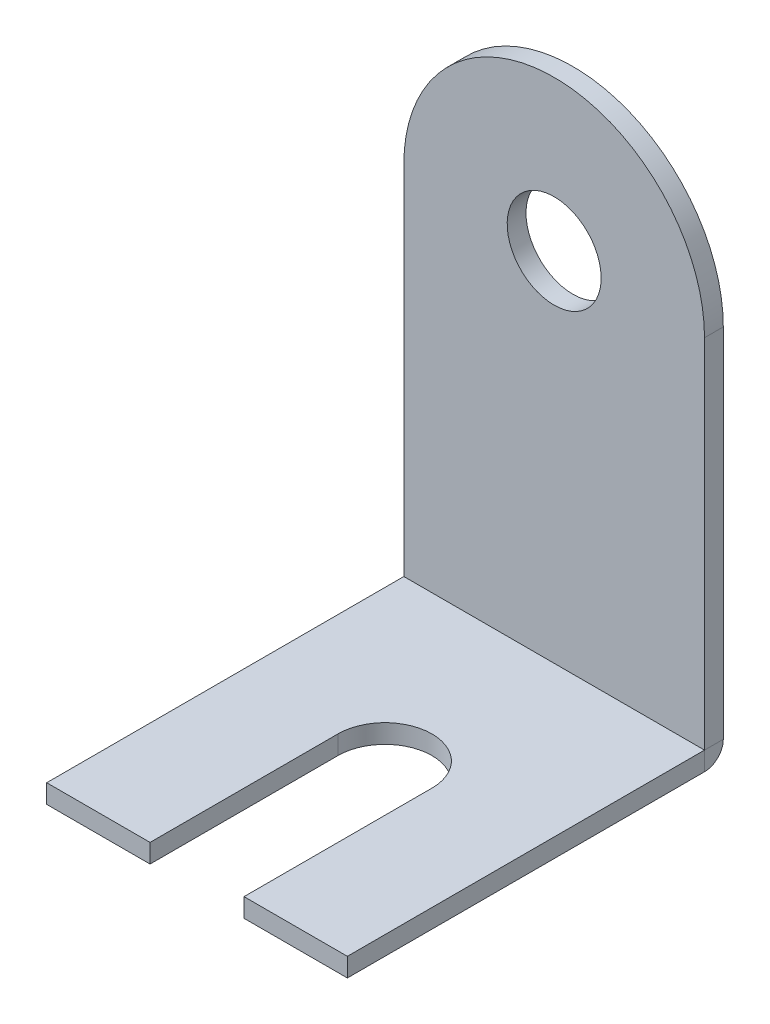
ISO-10303-21;
HEADER;
FILE_DESCRIPTION(('STEP AP214'),'2;1');
FILE_NAME('part.step','',(''),(''),'','','');
FILE_SCHEMA(('AUTOMOTIVE_DESIGN { 1 0 10303 214 1 1 1 1 }'));
ENDSEC;
DATA;
#1=APPLICATION_CONTEXT('core data for automotive mechanical design processes');
#2=APPLICATION_PROTOCOL_DEFINITION('international standard','automotive_design',2000,#1);
#3=PRODUCT_CONTEXT('',#1,'mechanical');
#4=PRODUCT('Part','Part','',(#3));
#5=PRODUCT_RELATED_PRODUCT_CATEGORY('part','',(#4));
#6=PRODUCT_DEFINITION_FORMATION('','',#4);
#7=PRODUCT_DEFINITION_CONTEXT('part definition',#1,'design');
#8=PRODUCT_DEFINITION('design','',#6,#7);
#9=PRODUCT_DEFINITION_SHAPE('','',#8);
#10=(LENGTH_UNIT() NAMED_UNIT(*) SI_UNIT(.MILLI.,.METRE.));
#11=(NAMED_UNIT(*) PLANE_ANGLE_UNIT() SI_UNIT($,.RADIAN.));
#12=(NAMED_UNIT(*) SI_UNIT($,.STERADIAN.) SOLID_ANGLE_UNIT());
#13=UNCERTAINTY_MEASURE_WITH_UNIT(LENGTH_MEASURE(1.E-05),#10,'distance_accuracy_value','');
#14=(GEOMETRIC_REPRESENTATION_CONTEXT(3) GLOBAL_UNCERTAINTY_ASSIGNED_CONTEXT((#13)) GLOBAL_UNIT_ASSIGNED_CONTEXT((#10,
#11,#12)) REPRESENTATION_CONTEXT('',''));
#15=CARTESIAN_POINT('',(0.,0.,0.));
#16=DIRECTION('',(0.,0.,1.));
#17=DIRECTION('',(1.,0.,0.));
#18=AXIS2_PLACEMENT_3D('',#15,#16,#17);
#19=CARTESIAN_POINT('',(16.,-19.995,-19.0050000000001));
#20=DIRECTION('',(-1.,0.,0.));
#21=DIRECTION('',(0.,-1.,0.));
#22=AXIS2_PLACEMENT_3D('',#19,#20,#21);
#23=PLANE('',#22);
#24=DIRECTION('',(0.,1.,0.));
#25=VECTOR('',#24,1.);
#26=CARTESIAN_POINT('',(16.,-19.995,-19.0050000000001));
#27=LINE('',#26,#25);
#28=CARTESIAN_POINT('',(16.,1.,-19.005));
#29=VERTEX_POINT('',#28);
#30=CARTESIAN_POINT('',(16.,20.005,-19.0049999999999));
#31=VERTEX_POINT('',#30);
#32=EDGE_CURVE('E39',#29,#31,#27,.T.);
#33=ORIENTED_EDGE('',*,*,#32,.F.);
#34=DIRECTION('',(0.,0.,-1.));
#35=VECTOR('',#34,1.);
#36=CARTESIAN_POINT('',(16.,1.,-19.005));
#37=LINE('',#36,#35);
#38=CARTESIAN_POINT('',(16.,1.,-20.005));
#39=VERTEX_POINT('',#38);
#40=EDGE_CURVE('E12',#29,#39,#37,.T.);
#41=ORIENTED_EDGE('',*,*,#40,.T.);
#42=DIRECTION('',(0.,1.,0.));
#43=VECTOR('',#42,1.);
#44=CARTESIAN_POINT('',(16.,-19.995,-20.0050000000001));
#45=LINE('',#44,#43);
#46=CARTESIAN_POINT('',(16.,20.005,-20.0049999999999));
#47=VERTEX_POINT('',#46);
#48=EDGE_CURVE('E146',#39,#47,#45,.T.);
#49=ORIENTED_EDGE('',*,*,#48,.T.);
#50=DIRECTION('',(0.,0.,-1.));
#51=VECTOR('',#50,1.);
#52=CARTESIAN_POINT('',(16.,20.005,-19.0049999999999));
#53=LINE('',#52,#51);
#54=EDGE_CURVE('E137',#31,#47,#53,.T.);
#55=ORIENTED_EDGE('',*,*,#54,.F.);
#56=EDGE_LOOP('',(#33,#41,#49,#55));
#57=FACE_BOUND('',#56,.T.);
#58=ADVANCED_FACE('F36',(#57),#23,.F.);
#59=CARTESIAN_POINT('',(0.,-19.995,-19.0050000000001));
#60=DIRECTION('',(1.,0.,0.));
#61=DIRECTION('',(0.,1.,0.));
#62=AXIS2_PLACEMENT_3D('',#59,#60,#61);
#63=PLANE('',#62);
#64=DIRECTION('',(0.,-1.,0.));
#65=VECTOR('',#64,1.);
#66=CARTESIAN_POINT('',(0.,-19.995,-20.0050000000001));
#67=LINE('',#66,#65);
#68=CARTESIAN_POINT('',(0.,20.005,-20.0049999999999));
#69=VERTEX_POINT('',#68);
#70=CARTESIAN_POINT('',(0.,1.00000000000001,-20.005));
#71=VERTEX_POINT('',#70);
#72=EDGE_CURVE('E141',#69,#71,#67,.T.);
#73=ORIENTED_EDGE('',*,*,#72,.T.);
#74=DIRECTION('',(0.,0.,1.));
#75=VECTOR('',#74,1.);
#76=CARTESIAN_POINT('',(0.,1.,-19.005));
#77=LINE('',#76,#75);
#78=CARTESIAN_POINT('',(0.,1.,-19.005));
#79=VERTEX_POINT('',#78);
#80=EDGE_CURVE('E130',#71,#79,#77,.T.);
#81=ORIENTED_EDGE('',*,*,#80,.T.);
#82=DIRECTION('',(0.,-1.,0.));
#83=VECTOR('',#82,1.);
#84=CARTESIAN_POINT('',(0.,-19.995,-19.0050000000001));
#85=LINE('',#84,#83);
#86=CARTESIAN_POINT('',(0.,20.005,-19.0049999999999));
#87=VERTEX_POINT('',#86);
#88=EDGE_CURVE('E155',#87,#79,#85,.T.);
#89=ORIENTED_EDGE('',*,*,#88,.F.);
#90=DIRECTION('',(0.,0.,-1.));
#91=VECTOR('',#90,1.);
#92=CARTESIAN_POINT('',(0.,20.005,-19.0049999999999));
#93=LINE('',#92,#91);
#94=EDGE_CURVE('E143',#87,#69,#93,.T.);
#95=ORIENTED_EDGE('',*,*,#94,.T.);
#96=EDGE_LOOP('',(#73,#81,#89,#95));
#97=FACE_BOUND('',#96,.T.);
#98=ADVANCED_FACE('F142',(#97),#63,.F.);
#99=CARTESIAN_POINT('',(8.,20.005,-20.0049999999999));
#100=DIRECTION('',(0.,0.,1.));
#101=DIRECTION('',(0.,-1.,0.));
#102=AXIS2_PLACEMENT_3D('',#99,#100,#101);
#103=PLANE('',#102);
#104=CARTESIAN_POINT('',(8.,20.005,-20.0049999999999));
#105=DIRECTION('',(0.,0.,1.));
#106=DIRECTION('',(0.,-1.,0.));
#107=AXIS2_PLACEMENT_3D('',#104,#105,#106);
#108=CIRCLE('',#107,2.5);
#109=CARTESIAN_POINT('',(8.,17.505,-20.0049999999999));
#110=VERTEX_POINT('',#109);
#111=EDGE_CURVE('E214',#110,#110,#108,.T.);
#112=ORIENTED_EDGE('',*,*,#111,.T.);
#113=EDGE_LOOP('',(#112));
#114=FACE_BOUND('',#113,.T.);
#115=ORIENTED_EDGE('',*,*,#48,.F.);
#116=DIRECTION('',(-1.,0.,0.));
#117=VECTOR('',#116,1.);
#118=CARTESIAN_POINT('',(8.,1.,-20.005));
#119=LINE('',#118,#117);
#120=EDGE_CURVE('E44',#39,#71,#119,.T.);
#121=ORIENTED_EDGE('',*,*,#120,.T.);
#122=ORIENTED_EDGE('',*,*,#72,.F.);
#123=CARTESIAN_POINT('',(8.,20.005,-20.0049999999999));
#124=DIRECTION('',(0.,0.,1.));
#125=DIRECTION('',(0.,-1.,0.));
#126=AXIS2_PLACEMENT_3D('',#123,#124,#125);
#127=CIRCLE('',#126,8.);
#128=EDGE_CURVE('E154',#47,#69,#127,.T.);
#129=ORIENTED_EDGE('',*,*,#128,.F.);
#130=EDGE_LOOP('',(#115,#121,#122,#129));
#131=FACE_BOUND('',#130,.T.);
#132=ADVANCED_FACE('F150',(#114,#131),#103,.F.);
#133=CARTESIAN_POINT('',(8.,20.005,-19.0049999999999));
#134=DIRECTION('',(0.,0.,1.));
#135=DIRECTION('',(0.,-1.,0.));
#136=AXIS2_PLACEMENT_3D('',#133,#134,#135);
#137=PLANE('',#136);
#138=DIRECTION('',(-1.,0.,0.));
#139=VECTOR('',#138,1.);
#140=CARTESIAN_POINT('',(8.,1.,-19.005));
#141=LINE('',#140,#139);
#142=EDGE_CURVE('E175',#29,#79,#141,.T.);
#143=ORIENTED_EDGE('',*,*,#142,.F.);
#144=ORIENTED_EDGE('',*,*,#32,.T.);
#145=CARTESIAN_POINT('',(8.,20.005,-19.0049999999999));
#146=DIRECTION('',(0.,0.,1.));
#147=DIRECTION('',(0.,-1.,0.));
#148=AXIS2_PLACEMENT_3D('',#145,#146,#147);
#149=CIRCLE('',#148,8.);
#150=EDGE_CURVE('E59',#31,#87,#149,.T.);
#151=ORIENTED_EDGE('',*,*,#150,.T.);
#152=ORIENTED_EDGE('',*,*,#88,.T.);
#153=EDGE_LOOP('',(#143,#144,#151,#152));
#154=FACE_BOUND('',#153,.T.);
#155=CARTESIAN_POINT('',(8.,20.005,-19.0049999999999));
#156=DIRECTION('',(0.,0.,1.));
#157=DIRECTION('',(0.,-1.,0.));
#158=AXIS2_PLACEMENT_3D('',#155,#156,#157);
#159=CIRCLE('',#158,2.5);
#160=CARTESIAN_POINT('',(8.,17.505,-19.0049999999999));
#161=VERTEX_POINT('',#160);
#162=EDGE_CURVE('E147',#161,#161,#159,.T.);
#163=ORIENTED_EDGE('',*,*,#162,.F.);
#164=EDGE_LOOP('',(#163));
#165=FACE_BOUND('',#164,.T.);
#166=ADVANCED_FACE('F176',(#154,#165),#137,.T.);
#167=CARTESIAN_POINT('',(8.,20.005,-19.0049999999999));
#168=DIRECTION('',(0.,0.,-1.));
#169=DIRECTION('',(0.,1.,0.));
#170=AXIS2_PLACEMENT_3D('',#167,#168,#169);
#171=CYLINDRICAL_SURFACE('',#170,8.);
#172=ORIENTED_EDGE('',*,*,#128,.T.);
#173=ORIENTED_EDGE('',*,*,#94,.F.);
#174=ORIENTED_EDGE('',*,*,#150,.F.);
#175=ORIENTED_EDGE('',*,*,#54,.T.);
#176=EDGE_LOOP('',(#172,#173,#174,#175));
#177=FACE_BOUND('',#176,.T.);
#178=ADVANCED_FACE('F165',(#177),#171,.T.);
#179=CARTESIAN_POINT('',(8.,20.005,-19.0049999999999));
#180=DIRECTION('',(0.,0.,-1.));
#181=DIRECTION('',(0.,1.,0.));
#182=AXIS2_PLACEMENT_3D('',#179,#180,#181);
#183=CYLINDRICAL_SURFACE('',#182,2.5);
#184=ORIENTED_EDGE('',*,*,#162,.T.);
#185=EDGE_LOOP('',(#184));
#186=FACE_BOUND('',#185,.T.);
#187=ORIENTED_EDGE('',*,*,#111,.F.);
#188=EDGE_LOOP('',(#187));
#189=FACE_BOUND('',#188,.T.);
#190=ADVANCED_FACE('F290',(#186,#189),#183,.F.);
#191=CARTESIAN_POINT('',(10.5,1.,0.));
#192=DIRECTION('',(0.,0.,-1.));
#193=DIRECTION('',(-1.,0.,0.));
#194=AXIS2_PLACEMENT_3D('',#191,#192,#193);
#195=PLANE('',#194);
#196=DIRECTION('',(1.,0.,0.));
#197=VECTOR('',#196,1.);
#198=CARTESIAN_POINT('',(10.5,0.,0.));
#199=LINE('',#198,#197);
#200=CARTESIAN_POINT('',(10.5,0.,0.));
#201=VERTEX_POINT('',#200);
#202=CARTESIAN_POINT('',(16.,0.,0.));
#203=VERTEX_POINT('',#202);
#204=EDGE_CURVE('E210',#201,#203,#199,.T.);
#205=ORIENTED_EDGE('',*,*,#204,.T.);
#206=DIRECTION('',(0.,-1.,0.));
#207=VECTOR('',#206,1.);
#208=CARTESIAN_POINT('',(16.,1.,0.));
#209=LINE('',#208,#207);
#210=CARTESIAN_POINT('',(16.,1.,0.));
#211=VERTEX_POINT('',#210);
#212=EDGE_CURVE('E220',#211,#203,#209,.T.);
#213=ORIENTED_EDGE('',*,*,#212,.F.);
#214=DIRECTION('',(1.,0.,0.));
#215=VECTOR('',#214,1.);
#216=CARTESIAN_POINT('',(10.5,1.,0.));
#217=LINE('',#216,#215);
#218=CARTESIAN_POINT('',(10.5,1.,0.));
#219=VERTEX_POINT('',#218);
#220=EDGE_CURVE('E230',#219,#211,#217,.T.);
#221=ORIENTED_EDGE('',*,*,#220,.F.);
#222=DIRECTION('',(0.,-1.,0.));
#223=VECTOR('',#222,1.);
#224=CARTESIAN_POINT('',(10.5,1.,0.));
#225=LINE('',#224,#223);
#226=EDGE_CURVE('E207',#219,#201,#225,.T.);
#227=ORIENTED_EDGE('',*,*,#226,.T.);
#228=EDGE_LOOP('',(#205,#213,#221,#227));
#229=FACE_BOUND('',#228,.T.);
#230=ADVANCED_FACE('F263',(#229),#195,.F.);
#231=CARTESIAN_POINT('',(10.5,1.,-10.));
#232=DIRECTION('',(1.,0.,0.));
#233=DIRECTION('',(0.,0.,-1.));
#234=AXIS2_PLACEMENT_3D('',#231,#232,#233);
#235=PLANE('',#234);
#236=DIRECTION('',(0.,0.,1.));
#237=VECTOR('',#236,1.);
#238=CARTESIAN_POINT('',(10.5,0.,-10.));
#239=LINE('',#238,#237);
#240=CARTESIAN_POINT('',(10.5,0.,-10.));
#241=VERTEX_POINT('',#240);
#242=EDGE_CURVE('E205',#241,#201,#239,.T.);
#243=ORIENTED_EDGE('',*,*,#242,.T.);
#244=ORIENTED_EDGE('',*,*,#226,.F.);
#245=DIRECTION('',(0.,0.,1.));
#246=VECTOR('',#245,1.);
#247=CARTESIAN_POINT('',(10.5,1.,-10.));
#248=LINE('',#247,#246);
#249=CARTESIAN_POINT('',(10.5,1.,-10.));
#250=VERTEX_POINT('',#249);
#251=EDGE_CURVE('E232',#250,#219,#248,.T.);
#252=ORIENTED_EDGE('',*,*,#251,.F.);
#253=DIRECTION('',(0.,-1.,0.));
#254=VECTOR('',#253,1.);
#255=CARTESIAN_POINT('',(10.5,1.,-10.));
#256=LINE('',#255,#254);
#257=EDGE_CURVE('E202',#250,#241,#256,.T.);
#258=ORIENTED_EDGE('',*,*,#257,.T.);
#259=EDGE_LOOP('',(#243,#244,#252,#258));
#260=FACE_BOUND('',#259,.T.);
#261=ADVANCED_FACE('F259',(#260),#235,.F.);
#262=CARTESIAN_POINT('',(8.,1.,-10.));
#263=DIRECTION('',(0.,-1.,0.));
#264=DIRECTION('',(0.,0.,-1.));
#265=AXIS2_PLACEMENT_3D('',#262,#263,#264);
#266=CYLINDRICAL_SURFACE('',#265,2.5);
#267=CARTESIAN_POINT('',(8.,0.,-10.));
#268=DIRECTION('',(0.,-1.,0.));
#269=DIRECTION('',(0.,0.,1.));
#270=AXIS2_PLACEMENT_3D('',#267,#268,#269);
#271=CIRCLE('',#270,2.5);
#272=CARTESIAN_POINT('',(5.5,0.,-10.));
#273=VERTEX_POINT('',#272);
#274=EDGE_CURVE('E200',#273,#241,#271,.T.);
#275=ORIENTED_EDGE('',*,*,#274,.T.);
#276=ORIENTED_EDGE('',*,*,#257,.F.);
#277=CARTESIAN_POINT('',(8.,1.,-10.));
#278=DIRECTION('',(0.,-1.,0.));
#279=DIRECTION('',(0.,0.,1.));
#280=AXIS2_PLACEMENT_3D('',#277,#278,#279);
#281=CIRCLE('',#280,2.5);
#282=CARTESIAN_POINT('',(5.5,1.,-10.));
#283=VERTEX_POINT('',#282);
#284=EDGE_CURVE('E234',#283,#250,#281,.T.);
#285=ORIENTED_EDGE('',*,*,#284,.F.);
#286=DIRECTION('',(0.,-1.,0.));
#287=VECTOR('',#286,1.);
#288=CARTESIAN_POINT('',(5.5,1.,-10.));
#289=LINE('',#288,#287);
#290=EDGE_CURVE('E197',#283,#273,#289,.T.);
#291=ORIENTED_EDGE('',*,*,#290,.T.);
#292=EDGE_LOOP('',(#275,#276,#285,#291));
#293=FACE_BOUND('',#292,.T.);
#294=ADVANCED_FACE('F253',(#293),#266,.F.);
#295=CARTESIAN_POINT('',(5.5,1.,-10.));
#296=DIRECTION('',(-1.,0.,0.));
#297=DIRECTION('',(0.,0.,1.));
#298=AXIS2_PLACEMENT_3D('',#295,#296,#297);
#299=PLANE('',#298);
#300=DIRECTION('',(0.,0.,-1.));
#301=VECTOR('',#300,1.);
#302=CARTESIAN_POINT('',(5.5,0.,-10.));
#303=LINE('',#302,#301);
#304=CARTESIAN_POINT('',(5.5,0.,0.));
#305=VERTEX_POINT('',#304);
#306=EDGE_CURVE('E195',#305,#273,#303,.T.);
#307=ORIENTED_EDGE('',*,*,#306,.T.);
#308=ORIENTED_EDGE('',*,*,#290,.F.);
#309=DIRECTION('',(0.,0.,-1.));
#310=VECTOR('',#309,1.);
#311=CARTESIAN_POINT('',(5.5,1.,-10.));
#312=LINE('',#311,#310);
#313=CARTESIAN_POINT('',(5.5,1.,0.));
#314=VERTEX_POINT('',#313);
#315=EDGE_CURVE('E236',#314,#283,#312,.T.);
#316=ORIENTED_EDGE('',*,*,#315,.F.);
#317=DIRECTION('',(0.,-1.,0.));
#318=VECTOR('',#317,1.);
#319=CARTESIAN_POINT('',(5.5,1.,0.));
#320=LINE('',#319,#318);
#321=EDGE_CURVE('E192',#314,#305,#320,.T.);
#322=ORIENTED_EDGE('',*,*,#321,.T.);
#323=EDGE_LOOP('',(#307,#308,#316,#322));
#324=FACE_BOUND('',#323,.T.);
#325=ADVANCED_FACE('F248',(#324),#299,.F.);
#326=CARTESIAN_POINT('',(0.,1.,0.));
#327=DIRECTION('',(0.,0.,-1.));
#328=DIRECTION('',(-1.,0.,0.));
#329=AXIS2_PLACEMENT_3D('',#326,#327,#328);
#330=PLANE('',#329);
#331=DIRECTION('',(1.,0.,0.));
#332=VECTOR('',#331,1.);
#333=CARTESIAN_POINT('',(0.,0.,0.));
#334=LINE('',#333,#332);
#335=CARTESIAN_POINT('',(0.,0.,0.));
#336=VERTEX_POINT('',#335);
#337=EDGE_CURVE('E190',#336,#305,#334,.T.);
#338=ORIENTED_EDGE('',*,*,#337,.T.);
#339=ORIENTED_EDGE('',*,*,#321,.F.);
#340=DIRECTION('',(1.,0.,0.));
#341=VECTOR('',#340,1.);
#342=CARTESIAN_POINT('',(0.,1.,0.));
#343=LINE('',#342,#341);
#344=CARTESIAN_POINT('',(0.,1.,0.));
#345=VERTEX_POINT('',#344);
#346=EDGE_CURVE('E182',#345,#314,#343,.T.);
#347=ORIENTED_EDGE('',*,*,#346,.F.);
#348=DIRECTION('',(0.,-1.,0.));
#349=VECTOR('',#348,1.);
#350=CARTESIAN_POINT('',(0.,1.,0.));
#351=LINE('',#350,#349);
#352=EDGE_CURVE('E184',#345,#336,#351,.T.);
#353=ORIENTED_EDGE('',*,*,#352,.T.);
#354=EDGE_LOOP('',(#338,#339,#347,#353));
#355=FACE_BOUND('',#354,.T.);
#356=ADVANCED_FACE('F244',(#355),#330,.F.);
#357=CARTESIAN_POINT('',(8.,1.,-40.));
#358=DIRECTION('',(0.,1.,0.));
#359=DIRECTION('',(0.,0.,1.));
#360=AXIS2_PLACEMENT_3D('',#357,#358,#359);
#361=PLANE('',#360);
#362=DIRECTION('',(0.,0.,-1.));
#363=VECTOR('',#362,1.);
#364=CARTESIAN_POINT('',(16.,1.,0.));
#365=LINE('',#364,#363);
#366=EDGE_CURVE('E180',#211,#29,#365,.T.);
#367=ORIENTED_EDGE('',*,*,#366,.T.);
#368=ORIENTED_EDGE('',*,*,#142,.T.);
#369=DIRECTION('',(0.,0.,1.));
#370=VECTOR('',#369,1.);
#371=CARTESIAN_POINT('',(0.,1.,0.));
#372=LINE('',#371,#370);
#373=EDGE_CURVE('E179',#79,#345,#372,.T.);
#374=ORIENTED_EDGE('',*,*,#373,.T.);
#375=ORIENTED_EDGE('',*,*,#346,.T.);
#376=ORIENTED_EDGE('',*,*,#315,.T.);
#377=ORIENTED_EDGE('',*,*,#284,.T.);
#378=ORIENTED_EDGE('',*,*,#251,.T.);
#379=ORIENTED_EDGE('',*,*,#220,.T.);
#380=EDGE_LOOP('',(#367,#368,#374,#375,#376,#377,#378,#379));
#381=FACE_BOUND('',#380,.T.);
#382=ADVANCED_FACE('F239',(#381),#361,.T.);
#383=CARTESIAN_POINT('',(0.,1.,0.));
#384=DIRECTION('',(1.,0.,0.));
#385=DIRECTION('',(0.,0.,-1.));
#386=AXIS2_PLACEMENT_3D('',#383,#384,#385);
#387=PLANE('',#386);
#388=DIRECTION('',(0.,1.,0.));
#389=VECTOR('',#388,1.);
#390=CARTESIAN_POINT('',(0.,0.999999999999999,-19.005));
#391=LINE('',#390,#389);
#392=CARTESIAN_POINT('',(0.,0.,-19.005));
#393=VERTEX_POINT('',#392);
#394=EDGE_CURVE('E134',#393,#79,#391,.T.);
#395=ORIENTED_EDGE('',*,*,#394,.F.);
#396=DIRECTION('',(0.,0.,1.));
#397=VECTOR('',#396,1.);
#398=CARTESIAN_POINT('',(0.,0.,0.));
#399=LINE('',#398,#397);
#400=EDGE_CURVE('E225',#393,#336,#399,.T.);
#401=ORIENTED_EDGE('',*,*,#400,.T.);
#402=ORIENTED_EDGE('',*,*,#352,.F.);
#403=ORIENTED_EDGE('',*,*,#373,.F.);
#404=EDGE_LOOP('',(#395,#401,#402,#403));
#405=FACE_BOUND('',#404,.T.);
#406=ADVANCED_FACE('F274',(#405),#387,.F.);
#407=CARTESIAN_POINT('',(8.,0.,-40.));
#408=DIRECTION('',(0.,1.,0.));
#409=DIRECTION('',(0.,0.,1.));
#410=AXIS2_PLACEMENT_3D('',#407,#408,#409);
#411=PLANE('',#410);
#412=DIRECTION('',(-1.,0.,0.));
#413=VECTOR('',#412,1.);
#414=CARTESIAN_POINT('',(8.,0.,-19.005));
#415=LINE('',#414,#413);
#416=CARTESIAN_POINT('',(16.,0.,-19.005));
#417=VERTEX_POINT('',#416);
#418=EDGE_CURVE('E124',#417,#393,#415,.T.);
#419=ORIENTED_EDGE('',*,*,#418,.F.);
#420=DIRECTION('',(0.,0.,-1.));
#421=VECTOR('',#420,1.);
#422=CARTESIAN_POINT('',(16.,0.,0.));
#423=LINE('',#422,#421);
#424=EDGE_CURVE('E216',#203,#417,#423,.T.);
#425=ORIENTED_EDGE('',*,*,#424,.F.);
#426=ORIENTED_EDGE('',*,*,#204,.F.);
#427=ORIENTED_EDGE('',*,*,#242,.F.);
#428=ORIENTED_EDGE('',*,*,#274,.F.);
#429=ORIENTED_EDGE('',*,*,#306,.F.);
#430=ORIENTED_EDGE('',*,*,#337,.F.);
#431=ORIENTED_EDGE('',*,*,#400,.F.);
#432=EDGE_LOOP('',(#419,#425,#426,#427,#428,#429,#430,#431));
#433=FACE_BOUND('',#432,.T.);
#434=ADVANCED_FACE('F267',(#433),#411,.F.);
#435=CARTESIAN_POINT('',(16.,1.,0.));
#436=DIRECTION('',(-1.,0.,0.));
#437=DIRECTION('',(0.,0.,1.));
#438=AXIS2_PLACEMENT_3D('',#435,#436,#437);
#439=PLANE('',#438);
#440=DIRECTION('',(0.,-1.,0.));
#441=VECTOR('',#440,1.);
#442=CARTESIAN_POINT('',(16.,0.999999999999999,-19.005));
#443=LINE('',#442,#441);
#444=EDGE_CURVE('E173',#29,#417,#443,.T.);
#445=ORIENTED_EDGE('',*,*,#444,.F.);
#446=ORIENTED_EDGE('',*,*,#366,.F.);
#447=ORIENTED_EDGE('',*,*,#212,.T.);
#448=ORIENTED_EDGE('',*,*,#424,.T.);
#449=EDGE_LOOP('',(#445,#446,#447,#448));
#450=FACE_BOUND('',#449,.T.);
#451=ADVANCED_FACE('F265',(#450),#439,.F.);
#452=CARTESIAN_POINT('',(16.,1.,-19.005));
#453=DIRECTION('',(-1.,0.,0.));
#454=DIRECTION('',(0.,0.,1.));
#455=AXIS2_PLACEMENT_3D('',#452,#453,#454);
#456=PLANE('',#455);
#457=CARTESIAN_POINT('',(16.,1.,-19.005));
#458=DIRECTION('',(-1.,0.,0.));
#459=DIRECTION('',(0.,0.,1.));
#460=AXIS2_PLACEMENT_3D('',#457,#458,#459);
#461=CIRCLE('',#460,1.);
#462=EDGE_CURVE('E127',#39,#417,#461,.T.);
#463=ORIENTED_EDGE('',*,*,#462,.F.);
#464=ORIENTED_EDGE('',*,*,#40,.F.);
#465=ORIENTED_EDGE('',*,*,#444,.T.);
#466=EDGE_LOOP('',(#463,#464,#465));
#467=FACE_BOUND('',#466,.T.);
#468=ADVANCED_FACE('F171',(#467),#456,.F.);
#469=CARTESIAN_POINT('',(0.,1.,-19.005));
#470=DIRECTION('',(-1.,0.,0.));
#471=DIRECTION('',(0.,0.,1.));
#472=AXIS2_PLACEMENT_3D('',#469,#470,#471);
#473=CYLINDRICAL_SURFACE('',#472,1.);
#474=CARTESIAN_POINT('',(0.,1.,-19.005));
#475=DIRECTION('',(-1.,0.,0.));
#476=DIRECTION('',(0.,0.,1.));
#477=AXIS2_PLACEMENT_3D('',#474,#475,#476);
#478=CIRCLE('',#477,1.);
#479=EDGE_CURVE('E120',#71,#393,#478,.T.);
#480=ORIENTED_EDGE('',*,*,#479,.F.);
#481=ORIENTED_EDGE('',*,*,#120,.F.);
#482=ORIENTED_EDGE('',*,*,#462,.T.);
#483=ORIENTED_EDGE('',*,*,#418,.T.);
#484=EDGE_LOOP('',(#480,#481,#482,#483));
#485=FACE_BOUND('',#484,.T.);
#486=ADVANCED_FACE('F122',(#485),#473,.T.);
#487=CARTESIAN_POINT('',(0.,1.,-19.005));
#488=DIRECTION('',(1.,0.,0.));
#489=DIRECTION('',(0.,0.,-1.));
#490=AXIS2_PLACEMENT_3D('',#487,#488,#489);
#491=PLANE('',#490);
#492=ORIENTED_EDGE('',*,*,#80,.F.);
#493=ORIENTED_EDGE('',*,*,#479,.T.);
#494=ORIENTED_EDGE('',*,*,#394,.T.);
#495=EDGE_LOOP('',(#492,#493,#494));
#496=FACE_BOUND('',#495,.T.);
#497=ADVANCED_FACE('F132',(#496),#491,.F.);
#498=CLOSED_SHELL('',(#58,#98,#132,#166,#178,#190,#230,#261,#294,#325,#356,#382,#406,#434,#451,
#468,#486,#497));
#499=MANIFOLD_SOLID_BREP('B2',#498);
#500=ADVANCED_BREP_SHAPE_REPRESENTATION('',(#18,#499),#14);
#501=SHAPE_DEFINITION_REPRESENTATION(#9,#500);
ENDSEC;
END-ISO-10303-21;
